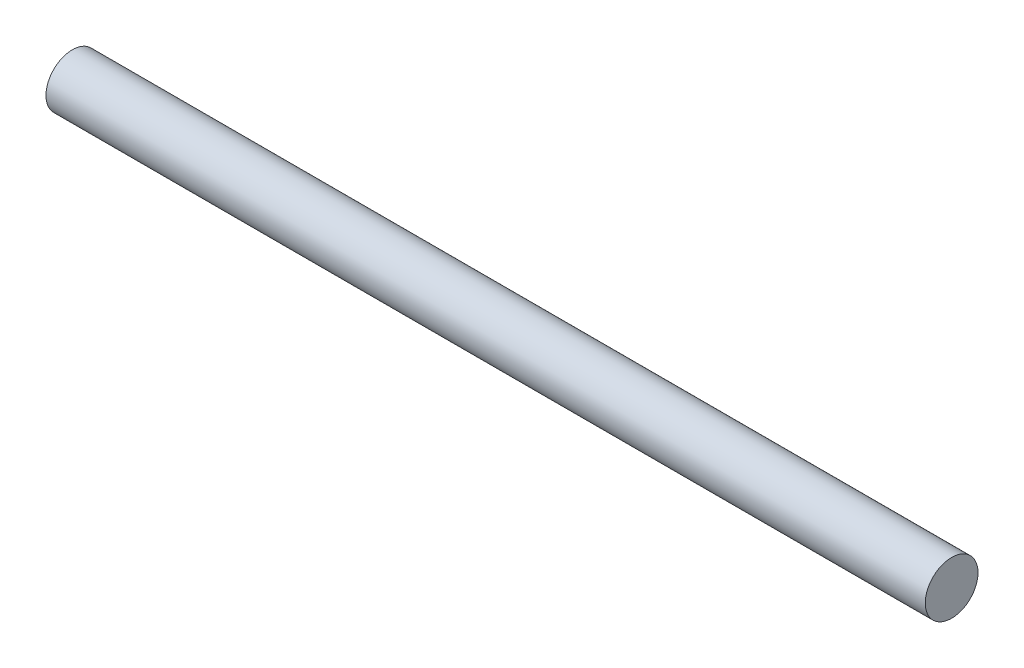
from build123d import *

# Parameters (mm, degrees)
BOSS_EXTRUDE1_DEPTH      = 25
BOSS_EXTRUDE1_DEPTH_BACK = 25
SKETCH1_R                = 1.5


with BuildPart() as part:
    # Sketch1 → Boss-Extrude1 (new, two sides: drawn at the far end of the back side and taken through both)
    with BuildSketch(Plane(origin=(0, 0, 0), x_dir=(0, 0, -1), z_dir=(1, 0, 0)).offset(-BOSS_EXTRUDE1_DEPTH_BACK)):
        Circle(SKETCH1_R)
    extrude(amount=BOSS_EXTRUDE1_DEPTH + BOSS_EXTRUDE1_DEPTH_BACK)


solid = part.part
